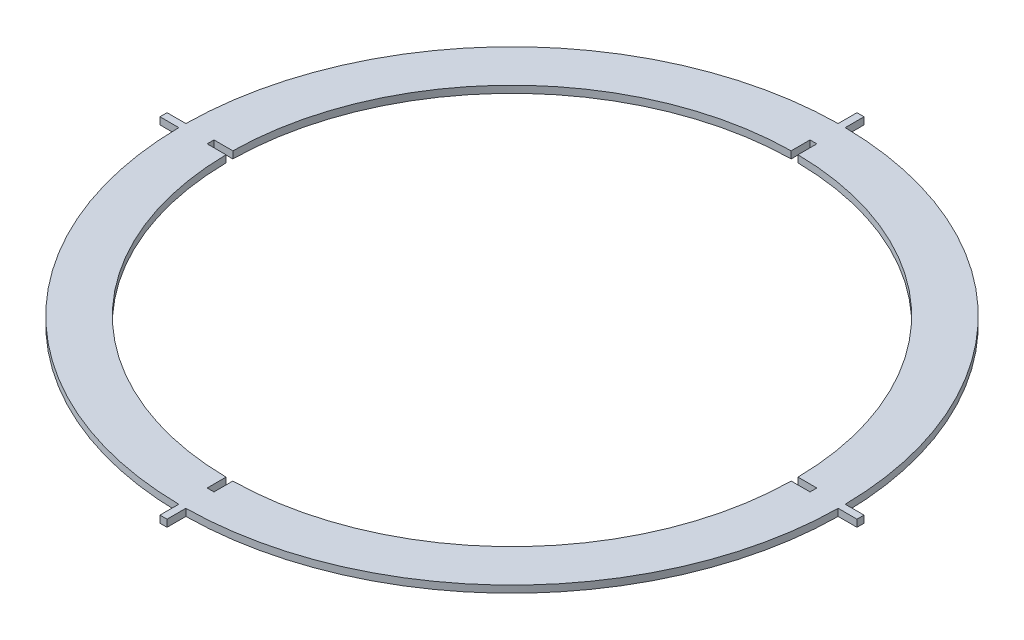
ISO-10303-21;
HEADER;
FILE_DESCRIPTION(('STEP AP214'),'2;1');
FILE_NAME('part.step','',(''),(''),'','','');
FILE_SCHEMA(('AUTOMOTIVE_DESIGN { 1 0 10303 214 1 1 1 1 }'));
ENDSEC;
DATA;
#1=APPLICATION_CONTEXT('core data for automotive mechanical design processes');
#2=APPLICATION_PROTOCOL_DEFINITION('international standard','automotive_design',2000,#1);
#3=PRODUCT_CONTEXT('',#1,'mechanical');
#4=PRODUCT('Part','Part','',(#3));
#5=PRODUCT_RELATED_PRODUCT_CATEGORY('part','',(#4));
#6=PRODUCT_DEFINITION_FORMATION('','',#4);
#7=PRODUCT_DEFINITION_CONTEXT('part definition',#1,'design');
#8=PRODUCT_DEFINITION('design','',#6,#7);
#9=PRODUCT_DEFINITION_SHAPE('','',#8);
#10=(LENGTH_UNIT() NAMED_UNIT(*) SI_UNIT(.MILLI.,.METRE.));
#11=(NAMED_UNIT(*) PLANE_ANGLE_UNIT() SI_UNIT($,.RADIAN.));
#12=(NAMED_UNIT(*) SI_UNIT($,.STERADIAN.) SOLID_ANGLE_UNIT());
#13=UNCERTAINTY_MEASURE_WITH_UNIT(LENGTH_MEASURE(1.E-05),#10,'distance_accuracy_value','');
#14=(GEOMETRIC_REPRESENTATION_CONTEXT(3) GLOBAL_UNCERTAINTY_ASSIGNED_CONTEXT((#13)) GLOBAL_UNIT_ASSIGNED_CONTEXT((#10,
#11,#12)) REPRESENTATION_CONTEXT('',''));
#15=CARTESIAN_POINT('',(0.,0.,0.));
#16=DIRECTION('',(0.,0.,1.));
#17=DIRECTION('',(1.,0.,0.));
#18=AXIS2_PLACEMENT_3D('',#15,#16,#17);
#19=CARTESIAN_POINT('',(0.,3.,-1.50000000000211));
#20=DIRECTION('',(0.,0.,1.));
#21=DIRECTION('',(1.,0.,0.));
#22=AXIS2_PLACEMENT_3D('',#19,#20,#21);
#23=PLANE('',#22);
#24=DIRECTION('',(-1.,0.,0.));
#25=VECTOR('',#24,1.);
#26=CARTESIAN_POINT('',(0.,0.,-1.50000000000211));
#27=LINE('',#26,#25);
#28=CARTESIAN_POINT('',(147.991964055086,0.,-1.50000000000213));
#29=VERTEX_POINT('',#28);
#30=CARTESIAN_POINT('',(139.991964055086,0.,-1.50000000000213));
#31=VERTEX_POINT('',#30);
#32=EDGE_CURVE('E322',#29,#31,#27,.T.);
#33=ORIENTED_EDGE('',*,*,#32,.T.);
#34=DIRECTION('',(0.,-1.,0.));
#35=VECTOR('',#34,1.);
#36=CARTESIAN_POINT('',(139.991964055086,3.,-1.50000000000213));
#37=LINE('',#36,#35);
#38=CARTESIAN_POINT('',(139.991964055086,3.,-1.50000000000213));
#39=VERTEX_POINT('',#38);
#40=EDGE_CURVE('E11',#39,#31,#37,.T.);
#41=ORIENTED_EDGE('',*,*,#40,.F.);
#42=DIRECTION('',(-1.,0.,0.));
#43=VECTOR('',#42,1.);
#44=CARTESIAN_POINT('',(0.,3.,-1.50000000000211));
#45=LINE('',#44,#43);
#46=CARTESIAN_POINT('',(147.991964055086,3.,-1.50000000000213));
#47=VERTEX_POINT('',#46);
#48=EDGE_CURVE('E480',#47,#39,#45,.T.);
#49=ORIENTED_EDGE('',*,*,#48,.F.);
#50=DIRECTION('',(0.,-1.,0.));
#51=VECTOR('',#50,1.);
#52=CARTESIAN_POINT('',(147.991964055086,3.,-1.50000000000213));
#53=LINE('',#52,#51);
#54=EDGE_CURVE('E360',#47,#29,#53,.T.);
#55=ORIENTED_EDGE('',*,*,#54,.T.);
#56=EDGE_LOOP('',(#33,#41,#49,#55));
#57=FACE_BOUND('',#56,.T.);
#58=ADVANCED_FACE('F35',(#57),#23,.F.);
#59=CARTESIAN_POINT('',(0.,3.,0.));
#60=DIRECTION('',(0.,-1.,0.));
#61=DIRECTION('',(0.,0.,-1.));
#62=AXIS2_PLACEMENT_3D('',#59,#60,#61);
#63=CYLINDRICAL_SURFACE('',#62,140.000000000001);
#64=CARTESIAN_POINT('',(0.,0.,0.));
#65=DIRECTION('',(0.,1.,0.));
#66=DIRECTION('',(0.,0.,1.));
#67=AXIS2_PLACEMENT_3D('',#64,#65,#66);
#68=CIRCLE('',#67,140.000000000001);
#69=CARTESIAN_POINT('',(1.50000000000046,0.,-139.991964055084));
#70=VERTEX_POINT('',#69);
#71=EDGE_CURVE('E325',#31,#70,#68,.T.);
#72=ORIENTED_EDGE('',*,*,#71,.T.);
#73=DIRECTION('',(0.,-1.,0.));
#74=VECTOR('',#73,1.);
#75=CARTESIAN_POINT('',(1.50000000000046,3.,-139.991964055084));
#76=LINE('',#75,#74);
#77=CARTESIAN_POINT('',(1.50000000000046,3.,-139.991964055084));
#78=VERTEX_POINT('',#77);
#79=EDGE_CURVE('E45',#78,#70,#76,.T.);
#80=ORIENTED_EDGE('',*,*,#79,.F.);
#81=CARTESIAN_POINT('',(0.,3.,0.));
#82=DIRECTION('',(0.,1.,0.));
#83=DIRECTION('',(0.,0.,1.));
#84=AXIS2_PLACEMENT_3D('',#81,#82,#83);
#85=CIRCLE('',#84,140.000000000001);
#86=EDGE_CURVE('E482',#39,#78,#85,.T.);
#87=ORIENTED_EDGE('',*,*,#86,.F.);
#88=ORIENTED_EDGE('',*,*,#40,.T.);
#89=EDGE_LOOP('',(#72,#80,#87,#88));
#90=FACE_BOUND('',#89,.T.);
#91=ADVANCED_FACE('F534',(#90),#63,.T.);
#92=CARTESIAN_POINT('',(1.49999999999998,3.,0.));
#93=DIRECTION('',(1.,0.,0.));
#94=DIRECTION('',(0.,0.,-1.));
#95=AXIS2_PLACEMENT_3D('',#92,#93,#94);
#96=PLANE('',#95);
#97=DIRECTION('',(0.,0.,1.));
#98=VECTOR('',#97,1.);
#99=CARTESIAN_POINT('',(1.49999999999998,0.,0.));
#100=LINE('',#99,#98);
#101=CARTESIAN_POINT('',(1.50000000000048,0.,-147.991964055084));
#102=VERTEX_POINT('',#101);
#103=EDGE_CURVE('E328',#102,#70,#100,.T.);
#104=ORIENTED_EDGE('',*,*,#103,.F.);
#105=DIRECTION('',(0.,-1.,0.));
#106=VECTOR('',#105,1.);
#107=CARTESIAN_POINT('',(1.50000000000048,3.,-147.991964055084));
#108=LINE('',#107,#106);
#109=CARTESIAN_POINT('',(1.50000000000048,3.,-147.991964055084));
#110=VERTEX_POINT('',#109);
#111=EDGE_CURVE('E387',#110,#102,#108,.T.);
#112=ORIENTED_EDGE('',*,*,#111,.F.);
#113=DIRECTION('',(0.,0.,1.));
#114=VECTOR('',#113,1.);
#115=CARTESIAN_POINT('',(1.49999999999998,3.,0.));
#116=LINE('',#115,#114);
#117=EDGE_CURVE('E484',#110,#78,#116,.T.);
#118=ORIENTED_EDGE('',*,*,#117,.T.);
#119=ORIENTED_EDGE('',*,*,#79,.T.);
#120=EDGE_LOOP('',(#104,#112,#118,#119));
#121=FACE_BOUND('',#120,.T.);
#122=ADVANCED_FACE('F539',(#121),#96,.T.);
#123=CARTESIAN_POINT('',(0.,3.,-147.991964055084));
#124=DIRECTION('',(0.,0.,1.));
#125=DIRECTION('',(1.,0.,0.));
#126=AXIS2_PLACEMENT_3D('',#123,#124,#125);
#127=PLANE('',#126);
#128=DIRECTION('',(-1.,0.,0.));
#129=VECTOR('',#128,1.);
#130=CARTESIAN_POINT('',(0.,0.,-147.991964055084));
#131=LINE('',#130,#129);
#132=CARTESIAN_POINT('',(-1.49999999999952,0.,-147.991964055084));
#133=VERTEX_POINT('',#132);
#134=EDGE_CURVE('E331',#102,#133,#131,.T.);
#135=ORIENTED_EDGE('',*,*,#134,.T.);
#136=DIRECTION('',(0.,-1.,0.));
#137=VECTOR('',#136,1.);
#138=CARTESIAN_POINT('',(-1.49999999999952,3.,-147.991964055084));
#139=LINE('',#138,#137);
#140=CARTESIAN_POINT('',(-1.49999999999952,3.,-147.991964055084));
#141=VERTEX_POINT('',#140);
#142=EDGE_CURVE('E384',#141,#133,#139,.T.);
#143=ORIENTED_EDGE('',*,*,#142,.F.);
#144=DIRECTION('',(-1.,0.,0.));
#145=VECTOR('',#144,1.);
#146=CARTESIAN_POINT('',(0.,3.,-147.991964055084));
#147=LINE('',#146,#145);
#148=EDGE_CURVE('E487',#110,#141,#147,.T.);
#149=ORIENTED_EDGE('',*,*,#148,.F.);
#150=ORIENTED_EDGE('',*,*,#111,.T.);
#151=EDGE_LOOP('',(#135,#143,#149,#150));
#152=FACE_BOUND('',#151,.T.);
#153=ADVANCED_FACE('F633',(#152),#127,.F.);
#154=CARTESIAN_POINT('',(-1.50000000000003,3.,0.));
#155=DIRECTION('',(1.,0.,0.));
#156=DIRECTION('',(0.,0.,-1.));
#157=AXIS2_PLACEMENT_3D('',#154,#155,#156);
#158=PLANE('',#157);
#159=DIRECTION('',(0.,0.,1.));
#160=VECTOR('',#159,1.);
#161=CARTESIAN_POINT('',(-1.50000000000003,0.,0.));
#162=LINE('',#161,#160);
#163=CARTESIAN_POINT('',(-1.49999999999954,0.,-139.991964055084));
#164=VERTEX_POINT('',#163);
#165=EDGE_CURVE('E333',#133,#164,#162,.T.);
#166=ORIENTED_EDGE('',*,*,#165,.T.);
#167=DIRECTION('',(0.,-1.,0.));
#168=VECTOR('',#167,1.);
#169=CARTESIAN_POINT('',(-1.49999999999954,3.,-139.991964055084));
#170=LINE('',#169,#168);
#171=CARTESIAN_POINT('',(-1.49999999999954,3.,-139.991964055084));
#172=VERTEX_POINT('',#171);
#173=EDGE_CURVE('E381',#172,#164,#170,.T.);
#174=ORIENTED_EDGE('',*,*,#173,.F.);
#175=DIRECTION('',(0.,0.,1.));
#176=VECTOR('',#175,1.);
#177=CARTESIAN_POINT('',(-1.50000000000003,3.,0.));
#178=LINE('',#177,#176);
#179=EDGE_CURVE('E489',#141,#172,#178,.T.);
#180=ORIENTED_EDGE('',*,*,#179,.F.);
#181=ORIENTED_EDGE('',*,*,#142,.T.);
#182=EDGE_LOOP('',(#166,#174,#180,#181));
#183=FACE_BOUND('',#182,.T.);
#184=ADVANCED_FACE('F629',(#183),#158,.F.);
#185=CARTESIAN_POINT('',(0.,3.,0.));
#186=DIRECTION('',(0.,-1.,0.));
#187=DIRECTION('',(0.,0.,-1.));
#188=AXIS2_PLACEMENT_3D('',#185,#186,#187);
#189=CYLINDRICAL_SURFACE('',#188,140.);
#190=CARTESIAN_POINT('',(0.,0.,0.));
#191=DIRECTION('',(0.,1.,0.));
#192=DIRECTION('',(0.,0.,1.));
#193=AXIS2_PLACEMENT_3D('',#190,#191,#192);
#194=CIRCLE('',#193,140.);
#195=CARTESIAN_POINT('',(-139.991964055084,0.,-1.49999999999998));
#196=VERTEX_POINT('',#195);
#197=EDGE_CURVE('E335',#164,#196,#194,.T.);
#198=ORIENTED_EDGE('',*,*,#197,.T.);
#199=DIRECTION('',(0.,-1.,0.));
#200=VECTOR('',#199,1.);
#201=CARTESIAN_POINT('',(-139.991964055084,3.,-1.49999999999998));
#202=LINE('',#201,#200);
#203=CARTESIAN_POINT('',(-139.991964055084,3.,-1.49999999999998));
#204=VERTEX_POINT('',#203);
#205=EDGE_CURVE('E379',#204,#196,#202,.T.);
#206=ORIENTED_EDGE('',*,*,#205,.F.);
#207=CARTESIAN_POINT('',(0.,3.,0.));
#208=DIRECTION('',(0.,1.,0.));
#209=DIRECTION('',(0.,0.,1.));
#210=AXIS2_PLACEMENT_3D('',#207,#208,#209);
#211=CIRCLE('',#210,140.);
#212=EDGE_CURVE('E491',#172,#204,#211,.T.);
#213=ORIENTED_EDGE('',*,*,#212,.F.);
#214=ORIENTED_EDGE('',*,*,#173,.T.);
#215=EDGE_LOOP('',(#198,#206,#213,#214));
#216=FACE_BOUND('',#215,.T.);
#217=ADVANCED_FACE('F625',(#216),#189,.T.);
#218=CARTESIAN_POINT('',(0.,3.,-1.5));
#219=DIRECTION('',(0.,0.,-1.));
#220=DIRECTION('',(-1.,0.,0.));
#221=AXIS2_PLACEMENT_3D('',#218,#219,#220);
#222=PLANE('',#221);
#223=DIRECTION('',(1.,0.,0.));
#224=VECTOR('',#223,1.);
#225=CARTESIAN_POINT('',(0.,0.,-1.5));
#226=LINE('',#225,#224);
#227=CARTESIAN_POINT('',(-147.991964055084,0.,-1.49999999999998));
#228=VERTEX_POINT('',#227);
#229=EDGE_CURVE('E338',#228,#196,#226,.T.);
#230=ORIENTED_EDGE('',*,*,#229,.F.);
#231=DIRECTION('',(0.,-1.,0.));
#232=VECTOR('',#231,1.);
#233=CARTESIAN_POINT('',(-147.991964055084,3.,-1.49999999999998));
#234=LINE('',#233,#232);
#235=CARTESIAN_POINT('',(-147.991964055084,3.,-1.49999999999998));
#236=VERTEX_POINT('',#235);
#237=EDGE_CURVE('E377',#236,#228,#234,.T.);
#238=ORIENTED_EDGE('',*,*,#237,.F.);
#239=DIRECTION('',(1.,0.,0.));
#240=VECTOR('',#239,1.);
#241=CARTESIAN_POINT('',(0.,3.,-1.5));
#242=LINE('',#241,#240);
#243=EDGE_CURVE('E493',#236,#204,#242,.T.);
#244=ORIENTED_EDGE('',*,*,#243,.T.);
#245=ORIENTED_EDGE('',*,*,#205,.T.);
#246=EDGE_LOOP('',(#230,#238,#244,#245));
#247=FACE_BOUND('',#246,.T.);
#248=ADVANCED_FACE('F621',(#247),#222,.T.);
#249=CARTESIAN_POINT('',(-147.991964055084,3.,0.));
#250=DIRECTION('',(1.,0.,0.));
#251=DIRECTION('',(0.,0.,-1.));
#252=AXIS2_PLACEMENT_3D('',#249,#250,#251);
#253=PLANE('',#252);
#254=DIRECTION('',(0.,0.,1.));
#255=VECTOR('',#254,1.);
#256=CARTESIAN_POINT('',(-147.991964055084,0.,0.));
#257=LINE('',#256,#255);
#258=CARTESIAN_POINT('',(-147.991964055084,0.,1.50000000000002));
#259=VERTEX_POINT('',#258);
#260=EDGE_CURVE('E341',#228,#259,#257,.T.);
#261=ORIENTED_EDGE('',*,*,#260,.T.);
#262=DIRECTION('',(0.,-1.,0.));
#263=VECTOR('',#262,1.);
#264=CARTESIAN_POINT('',(-147.991964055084,3.,1.50000000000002));
#265=LINE('',#264,#263);
#266=CARTESIAN_POINT('',(-147.991964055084,3.,1.50000000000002));
#267=VERTEX_POINT('',#266);
#268=EDGE_CURVE('E374',#267,#259,#265,.T.);
#269=ORIENTED_EDGE('',*,*,#268,.F.);
#270=DIRECTION('',(0.,0.,1.));
#271=VECTOR('',#270,1.);
#272=CARTESIAN_POINT('',(-147.991964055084,3.,0.));
#273=LINE('',#272,#271);
#274=EDGE_CURVE('E496',#236,#267,#273,.T.);
#275=ORIENTED_EDGE('',*,*,#274,.F.);
#276=ORIENTED_EDGE('',*,*,#237,.T.);
#277=EDGE_LOOP('',(#261,#269,#275,#276));
#278=FACE_BOUND('',#277,.T.);
#279=ADVANCED_FACE('F617',(#278),#253,.F.);
#280=CARTESIAN_POINT('',(0.,3.,1.50000000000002));
#281=DIRECTION('',(0.,0.,-1.));
#282=DIRECTION('',(-1.,0.,0.));
#283=AXIS2_PLACEMENT_3D('',#280,#281,#282);
#284=PLANE('',#283);
#285=DIRECTION('',(1.,0.,0.));
#286=VECTOR('',#285,1.);
#287=CARTESIAN_POINT('',(0.,0.,1.50000000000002));
#288=LINE('',#287,#286);
#289=CARTESIAN_POINT('',(-139.991964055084,0.,1.50000000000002));
#290=VERTEX_POINT('',#289);
#291=EDGE_CURVE('E343',#259,#290,#288,.T.);
#292=ORIENTED_EDGE('',*,*,#291,.T.);
#293=DIRECTION('',(0.,-1.,0.));
#294=VECTOR('',#293,1.);
#295=CARTESIAN_POINT('',(-139.991964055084,3.,1.50000000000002));
#296=LINE('',#295,#294);
#297=CARTESIAN_POINT('',(-139.991964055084,3.,1.50000000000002));
#298=VERTEX_POINT('',#297);
#299=EDGE_CURVE('E371',#298,#290,#296,.T.);
#300=ORIENTED_EDGE('',*,*,#299,.F.);
#301=DIRECTION('',(1.,0.,0.));
#302=VECTOR('',#301,1.);
#303=CARTESIAN_POINT('',(0.,3.,1.50000000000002));
#304=LINE('',#303,#302);
#305=EDGE_CURVE('E498',#267,#298,#304,.T.);
#306=ORIENTED_EDGE('',*,*,#305,.F.);
#307=ORIENTED_EDGE('',*,*,#268,.T.);
#308=EDGE_LOOP('',(#292,#300,#306,#307));
#309=FACE_BOUND('',#308,.T.);
#310=ADVANCED_FACE('F613',(#309),#284,.F.);
#311=CARTESIAN_POINT('',(0.,3.,0.));
#312=DIRECTION('',(0.,-1.,0.));
#313=DIRECTION('',(0.,0.,-1.));
#314=AXIS2_PLACEMENT_3D('',#311,#312,#313);
#315=CYLINDRICAL_SURFACE('',#314,140.);
#316=CARTESIAN_POINT('',(0.,0.,0.));
#317=DIRECTION('',(0.,1.,0.));
#318=DIRECTION('',(0.,0.,1.));
#319=AXIS2_PLACEMENT_3D('',#316,#317,#318);
#320=CIRCLE('',#319,140.);
#321=CARTESIAN_POINT('',(-1.49999999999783,0.,139.991964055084));
#322=VERTEX_POINT('',#321);
#323=EDGE_CURVE('E345',#290,#322,#320,.T.);
#324=ORIENTED_EDGE('',*,*,#323,.T.);
#325=DIRECTION('',(0.,-1.,0.));
#326=VECTOR('',#325,1.);
#327=CARTESIAN_POINT('',(-1.49999999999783,3.,139.991964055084));
#328=LINE('',#327,#326);
#329=CARTESIAN_POINT('',(-1.49999999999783,3.,139.991964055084));
#330=VERTEX_POINT('',#329);
#331=EDGE_CURVE('E369',#330,#322,#328,.T.);
#332=ORIENTED_EDGE('',*,*,#331,.F.);
#333=CARTESIAN_POINT('',(0.,3.,0.));
#334=DIRECTION('',(0.,1.,0.));
#335=DIRECTION('',(0.,0.,1.));
#336=AXIS2_PLACEMENT_3D('',#333,#334,#335);
#337=CIRCLE('',#336,140.);
#338=EDGE_CURVE('E500',#298,#330,#337,.T.);
#339=ORIENTED_EDGE('',*,*,#338,.F.);
#340=ORIENTED_EDGE('',*,*,#299,.T.);
#341=EDGE_LOOP('',(#324,#332,#339,#340));
#342=FACE_BOUND('',#341,.T.);
#343=ADVANCED_FACE('F609',(#342),#315,.T.);
#344=CARTESIAN_POINT('',(-1.49999999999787,3.,0.));
#345=DIRECTION('',(-1.,0.,0.));
#346=DIRECTION('',(0.,0.,1.));
#347=AXIS2_PLACEMENT_3D('',#344,#345,#346);
#348=PLANE('',#347);
#349=DIRECTION('',(0.,0.,-1.));
#350=VECTOR('',#349,1.);
#351=CARTESIAN_POINT('',(-1.49999999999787,0.,0.));
#352=LINE('',#351,#350);
#353=CARTESIAN_POINT('',(-1.49999999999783,0.,147.991964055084));
#354=VERTEX_POINT('',#353);
#355=EDGE_CURVE('E348',#354,#322,#352,.T.);
#356=ORIENTED_EDGE('',*,*,#355,.F.);
#357=DIRECTION('',(0.,-1.,0.));
#358=VECTOR('',#357,1.);
#359=CARTESIAN_POINT('',(-1.49999999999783,3.,147.991964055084));
#360=LINE('',#359,#358);
#361=CARTESIAN_POINT('',(-1.49999999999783,3.,147.991964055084));
#362=VERTEX_POINT('',#361);
#363=EDGE_CURVE('E367',#362,#354,#360,.T.);
#364=ORIENTED_EDGE('',*,*,#363,.F.);
#365=DIRECTION('',(0.,0.,-1.));
#366=VECTOR('',#365,1.);
#367=CARTESIAN_POINT('',(-1.49999999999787,3.,0.));
#368=LINE('',#367,#366);
#369=EDGE_CURVE('E502',#362,#330,#368,.T.);
#370=ORIENTED_EDGE('',*,*,#369,.T.);
#371=ORIENTED_EDGE('',*,*,#331,.T.);
#372=EDGE_LOOP('',(#356,#364,#370,#371));
#373=FACE_BOUND('',#372,.T.);
#374=ADVANCED_FACE('F606',(#373),#348,.T.);
#375=CARTESIAN_POINT('',(0.,3.,147.991964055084));
#376=DIRECTION('',(0.,0.,-1.));
#377=DIRECTION('',(-1.,0.,0.));
#378=AXIS2_PLACEMENT_3D('',#375,#376,#377);
#379=PLANE('',#378);
#380=DIRECTION('',(1.,0.,0.));
#381=VECTOR('',#380,1.);
#382=CARTESIAN_POINT('',(0.,0.,147.991964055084));
#383=LINE('',#382,#381);
#384=CARTESIAN_POINT('',(1.50000000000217,0.,147.991964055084));
#385=VERTEX_POINT('',#384);
#386=EDGE_CURVE('E351',#354,#385,#383,.T.);
#387=ORIENTED_EDGE('',*,*,#386,.T.);
#388=DIRECTION('',(0.,-1.,0.));
#389=VECTOR('',#388,1.);
#390=CARTESIAN_POINT('',(1.50000000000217,3.,147.991964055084));
#391=LINE('',#390,#389);
#392=CARTESIAN_POINT('',(1.50000000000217,3.,147.991964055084));
#393=VERTEX_POINT('',#392);
#394=EDGE_CURVE('E364',#393,#385,#391,.T.);
#395=ORIENTED_EDGE('',*,*,#394,.F.);
#396=DIRECTION('',(1.,0.,0.));
#397=VECTOR('',#396,1.);
#398=CARTESIAN_POINT('',(0.,3.,147.991964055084));
#399=LINE('',#398,#397);
#400=EDGE_CURVE('E505',#362,#393,#399,.T.);
#401=ORIENTED_EDGE('',*,*,#400,.F.);
#402=ORIENTED_EDGE('',*,*,#363,.T.);
#403=EDGE_LOOP('',(#387,#395,#401,#402));
#404=FACE_BOUND('',#403,.T.);
#405=ADVANCED_FACE('F510',(#404),#379,.F.);
#406=CARTESIAN_POINT('',(1.50000000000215,3.,0.));
#407=DIRECTION('',(-1.,0.,0.));
#408=DIRECTION('',(0.,0.,1.));
#409=AXIS2_PLACEMENT_3D('',#406,#407,#408);
#410=PLANE('',#409);
#411=DIRECTION('',(0.,0.,-1.));
#412=VECTOR('',#411,1.);
#413=CARTESIAN_POINT('',(1.50000000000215,0.,0.));
#414=LINE('',#413,#412);
#415=CARTESIAN_POINT('',(1.50000000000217,0.,139.991964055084));
#416=VERTEX_POINT('',#415);
#417=EDGE_CURVE('E353',#385,#416,#414,.T.);
#418=ORIENTED_EDGE('',*,*,#417,.T.);
#419=DIRECTION('',(0.,-1.,0.));
#420=VECTOR('',#419,1.);
#421=CARTESIAN_POINT('',(1.50000000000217,3.,139.991964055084));
#422=LINE('',#421,#420);
#423=CARTESIAN_POINT('',(1.50000000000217,3.,139.991964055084));
#424=VERTEX_POINT('',#423);
#425=EDGE_CURVE('E270',#424,#416,#422,.T.);
#426=ORIENTED_EDGE('',*,*,#425,.F.);
#427=DIRECTION('',(0.,0.,-1.));
#428=VECTOR('',#427,1.);
#429=CARTESIAN_POINT('',(1.50000000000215,3.,0.));
#430=LINE('',#429,#428);
#431=EDGE_CURVE('E257',#393,#424,#430,.T.);
#432=ORIENTED_EDGE('',*,*,#431,.F.);
#433=ORIENTED_EDGE('',*,*,#394,.T.);
#434=EDGE_LOOP('',(#418,#426,#432,#433));
#435=FACE_BOUND('',#434,.T.);
#436=ADVANCED_FACE('F514',(#435),#410,.F.);
#437=CARTESIAN_POINT('',(0.,3.,0.));
#438=DIRECTION('',(0.,-1.,0.));
#439=DIRECTION('',(0.,0.,-1.));
#440=AXIS2_PLACEMENT_3D('',#437,#438,#439);
#441=CYLINDRICAL_SURFACE('',#440,140.000000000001);
#442=CARTESIAN_POINT('',(0.,0.,0.));
#443=DIRECTION('',(0.,1.,0.));
#444=DIRECTION('',(0.,0.,1.));
#445=AXIS2_PLACEMENT_3D('',#442,#443,#444);
#446=CIRCLE('',#445,140.000000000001);
#447=CARTESIAN_POINT('',(139.991964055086,0.,1.49999999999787));
#448=VERTEX_POINT('',#447);
#449=EDGE_CURVE('E266',#416,#448,#446,.T.);
#450=ORIENTED_EDGE('',*,*,#449,.T.);
#451=DIRECTION('',(0.,-1.,0.));
#452=VECTOR('',#451,1.);
#453=CARTESIAN_POINT('',(139.991964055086,3.,1.49999999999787));
#454=LINE('',#453,#452);
#455=CARTESIAN_POINT('',(139.991964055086,3.,1.49999999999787));
#456=VERTEX_POINT('',#455);
#457=EDGE_CURVE('E263',#456,#448,#454,.T.);
#458=ORIENTED_EDGE('',*,*,#457,.F.);
#459=CARTESIAN_POINT('',(0.,3.,0.));
#460=DIRECTION('',(0.,1.,0.));
#461=DIRECTION('',(0.,0.,1.));
#462=AXIS2_PLACEMENT_3D('',#459,#460,#461);
#463=CIRCLE('',#462,140.000000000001);
#464=EDGE_CURVE('E251',#424,#456,#463,.T.);
#465=ORIENTED_EDGE('',*,*,#464,.F.);
#466=ORIENTED_EDGE('',*,*,#425,.T.);
#467=EDGE_LOOP('',(#450,#458,#465,#466));
#468=FACE_BOUND('',#467,.T.);
#469=ADVANCED_FACE('F264',(#468),#441,.T.);
#470=CARTESIAN_POINT('',(0.,3.,1.49999999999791));
#471=DIRECTION('',(0.,0.,1.));
#472=DIRECTION('',(1.,0.,0.));
#473=AXIS2_PLACEMENT_3D('',#470,#471,#472);
#474=PLANE('',#473);
#475=DIRECTION('',(-1.,0.,0.));
#476=VECTOR('',#475,1.);
#477=CARTESIAN_POINT('',(0.,0.,1.49999999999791));
#478=LINE('',#477,#476);
#479=CARTESIAN_POINT('',(147.991964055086,0.,1.49999999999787));
#480=VERTEX_POINT('',#479);
#481=EDGE_CURVE('E356',#480,#448,#478,.T.);
#482=ORIENTED_EDGE('',*,*,#481,.F.);
#483=DIRECTION('',(0.,-1.,0.));
#484=VECTOR('',#483,1.);
#485=CARTESIAN_POINT('',(147.991964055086,3.,1.49999999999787));
#486=LINE('',#485,#484);
#487=CARTESIAN_POINT('',(147.991964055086,3.,1.49999999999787));
#488=VERTEX_POINT('',#487);
#489=EDGE_CURVE('E154',#488,#480,#486,.T.);
#490=ORIENTED_EDGE('',*,*,#489,.F.);
#491=DIRECTION('',(-1.,0.,0.));
#492=VECTOR('',#491,1.);
#493=CARTESIAN_POINT('',(0.,3.,1.49999999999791));
#494=LINE('',#493,#492);
#495=EDGE_CURVE('E255',#488,#456,#494,.T.);
#496=ORIENTED_EDGE('',*,*,#495,.T.);
#497=ORIENTED_EDGE('',*,*,#457,.T.);
#498=EDGE_LOOP('',(#482,#490,#496,#497));
#499=FACE_BOUND('',#498,.T.);
#500=ADVANCED_FACE('F272',(#499),#474,.T.);
#501=CARTESIAN_POINT('',(0.,3.,0.));
#502=DIRECTION('',(0.,-1.,0.));
#503=DIRECTION('',(0.,0.,-1.));
#504=AXIS2_PLACEMENT_3D('',#501,#502,#503);
#505=CYLINDRICAL_SURFACE('',#504,120.);
#506=CARTESIAN_POINT('',(0.,0.,0.));
#507=DIRECTION('',(0.,1.,0.));
#508=DIRECTION('',(0.,0.,1.));
#509=AXIS2_PLACEMENT_3D('',#506,#507,#508);
#510=CIRCLE('',#509,120.);
#511=CARTESIAN_POINT('',(119.99123926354,0.,-1.45000000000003));
#512=VERTEX_POINT('',#511);
#513=CARTESIAN_POINT('',(1.44999999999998,0.,-119.99123926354));
#514=VERTEX_POINT('',#513);
#515=EDGE_CURVE('E278',#512,#514,#510,.T.);
#516=ORIENTED_EDGE('',*,*,#515,.F.);
#517=DIRECTION('',(0.,-1.,0.));
#518=VECTOR('',#517,1.);
#519=CARTESIAN_POINT('',(119.99123926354,3.,-1.45000000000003));
#520=LINE('',#519,#518);
#521=CARTESIAN_POINT('',(119.99123926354,3.,-1.45000000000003));
#522=VERTEX_POINT('',#521);
#523=EDGE_CURVE('E39',#522,#512,#520,.T.);
#524=ORIENTED_EDGE('',*,*,#523,.F.);
#525=CARTESIAN_POINT('',(0.,3.,0.));
#526=DIRECTION('',(0.,1.,0.));
#527=DIRECTION('',(0.,0.,1.));
#528=AXIS2_PLACEMENT_3D('',#525,#526,#527);
#529=CIRCLE('',#528,120.);
#530=CARTESIAN_POINT('',(1.44999999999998,3.,-119.99123926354));
#531=VERTEX_POINT('',#530);
#532=EDGE_CURVE('E359',#522,#531,#529,.T.);
#533=ORIENTED_EDGE('',*,*,#532,.T.);
#534=DIRECTION('',(0.,-1.,0.));
#535=VECTOR('',#534,1.);
#536=CARTESIAN_POINT('',(1.44999999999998,3.,-119.99123926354));
#537=LINE('',#536,#535);
#538=EDGE_CURVE('E274',#531,#514,#537,.T.);
#539=ORIENTED_EDGE('',*,*,#538,.T.);
#540=EDGE_LOOP('',(#516,#524,#533,#539));
#541=FACE_BOUND('',#540,.T.);
#542=ADVANCED_FACE('F37',(#541),#505,.F.);
#543=CARTESIAN_POINT('',(0.,3.,-1.45000000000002));
#544=DIRECTION('',(0.,0.,1.));
#545=DIRECTION('',(1.,0.,0.));
#546=AXIS2_PLACEMENT_3D('',#543,#544,#545);
#547=PLANE('',#546);
#548=DIRECTION('',(-1.,0.,0.));
#549=VECTOR('',#548,1.);
#550=CARTESIAN_POINT('',(0.,0.,-1.45000000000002));
#551=LINE('',#550,#549);
#552=CARTESIAN_POINT('',(127.99123926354,0.,-1.45000000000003));
#553=VERTEX_POINT('',#552);
#554=EDGE_CURVE('E281',#553,#512,#551,.T.);
#555=ORIENTED_EDGE('',*,*,#554,.F.);
#556=DIRECTION('',(0.,-1.,0.));
#557=VECTOR('',#556,1.);
#558=CARTESIAN_POINT('',(127.99123926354,3.,-1.45000000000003));
#559=LINE('',#558,#557);
#560=CARTESIAN_POINT('',(127.99123926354,3.,-1.45000000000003));
#561=VERTEX_POINT('',#560);
#562=EDGE_CURVE('E420',#561,#553,#559,.T.);
#563=ORIENTED_EDGE('',*,*,#562,.F.);
#564=DIRECTION('',(-1.,0.,0.));
#565=VECTOR('',#564,1.);
#566=CARTESIAN_POINT('',(0.,3.,-1.45000000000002));
#567=LINE('',#566,#565);
#568=EDGE_CURVE('E429',#561,#522,#567,.T.);
#569=ORIENTED_EDGE('',*,*,#568,.T.);
#570=ORIENTED_EDGE('',*,*,#523,.T.);
#571=EDGE_LOOP('',(#555,#563,#569,#570));
#572=FACE_BOUND('',#571,.T.);
#573=ADVANCED_FACE('F427',(#572),#547,.T.);
#574=CARTESIAN_POINT('',(127.99123926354,3.,0.));
#575=DIRECTION('',(1.,0.,0.));
#576=DIRECTION('',(0.,0.,-1.));
#577=AXIS2_PLACEMENT_3D('',#574,#575,#576);
#578=PLANE('',#577);
#579=DIRECTION('',(0.,0.,1.));
#580=VECTOR('',#579,1.);
#581=CARTESIAN_POINT('',(127.99123926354,0.,0.));
#582=LINE('',#581,#580);
#583=CARTESIAN_POINT('',(127.99123926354,0.,1.44999999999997));
#584=VERTEX_POINT('',#583);
#585=EDGE_CURVE('E284',#553,#584,#582,.T.);
#586=ORIENTED_EDGE('',*,*,#585,.T.);
#587=DIRECTION('',(0.,-1.,0.));
#588=VECTOR('',#587,1.);
#589=CARTESIAN_POINT('',(127.99123926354,3.,1.44999999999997));
#590=LINE('',#589,#588);
#591=CARTESIAN_POINT('',(127.99123926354,3.,1.44999999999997));
#592=VERTEX_POINT('',#591);
#593=EDGE_CURVE('E418',#592,#584,#590,.T.);
#594=ORIENTED_EDGE('',*,*,#593,.F.);
#595=DIRECTION('',(0.,0.,1.));
#596=VECTOR('',#595,1.);
#597=CARTESIAN_POINT('',(127.99123926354,3.,0.));
#598=LINE('',#597,#596);
#599=EDGE_CURVE('E447',#561,#592,#598,.T.);
#600=ORIENTED_EDGE('',*,*,#599,.F.);
#601=ORIENTED_EDGE('',*,*,#562,.T.);
#602=EDGE_LOOP('',(#586,#594,#600,#601));
#603=FACE_BOUND('',#602,.T.);
#604=ADVANCED_FACE('F437',(#603),#578,.F.);
#605=CARTESIAN_POINT('',(0.,3.,1.45000000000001));
#606=DIRECTION('',(0.,0.,1.));
#607=DIRECTION('',(1.,0.,0.));
#608=AXIS2_PLACEMENT_3D('',#605,#606,#607);
#609=PLANE('',#608);
#610=DIRECTION('',(-1.,0.,0.));
#611=VECTOR('',#610,1.);
#612=CARTESIAN_POINT('',(0.,0.,1.45000000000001));
#613=LINE('',#612,#611);
#614=CARTESIAN_POINT('',(119.99123926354,0.,1.44999999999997));
#615=VERTEX_POINT('',#614);
#616=EDGE_CURVE('E286',#584,#615,#613,.T.);
#617=ORIENTED_EDGE('',*,*,#616,.T.);
#618=DIRECTION('',(0.,-1.,0.));
#619=VECTOR('',#618,1.);
#620=CARTESIAN_POINT('',(119.99123926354,3.,1.44999999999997));
#621=LINE('',#620,#619);
#622=CARTESIAN_POINT('',(119.99123926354,3.,1.44999999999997));
#623=VERTEX_POINT('',#622);
#624=EDGE_CURVE('E416',#623,#615,#621,.T.);
#625=ORIENTED_EDGE('',*,*,#624,.F.);
#626=DIRECTION('',(-1.,0.,0.));
#627=VECTOR('',#626,1.);
#628=CARTESIAN_POINT('',(0.,3.,1.45000000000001));
#629=LINE('',#628,#627);
#630=EDGE_CURVE('E442',#592,#623,#629,.T.);
#631=ORIENTED_EDGE('',*,*,#630,.F.);
#632=ORIENTED_EDGE('',*,*,#593,.T.);
#633=EDGE_LOOP('',(#617,#625,#631,#632));
#634=FACE_BOUND('',#633,.T.);
#635=ADVANCED_FACE('F440',(#634),#609,.F.);
#636=CARTESIAN_POINT('',(0.,3.,0.));
#637=DIRECTION('',(0.,-1.,0.));
#638=DIRECTION('',(0.,0.,-1.));
#639=AXIS2_PLACEMENT_3D('',#636,#637,#638);
#640=CYLINDRICAL_SURFACE('',#639,120.);
#641=CARTESIAN_POINT('',(0.,0.,0.));
#642=DIRECTION('',(0.,1.,0.));
#643=DIRECTION('',(0.,0.,1.));
#644=AXIS2_PLACEMENT_3D('',#641,#642,#643);
#645=CIRCLE('',#644,120.);
#646=CARTESIAN_POINT('',(1.45000000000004,0.,119.99123926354));
#647=VERTEX_POINT('',#646);
#648=EDGE_CURVE('E289',#647,#615,#645,.T.);
#649=ORIENTED_EDGE('',*,*,#648,.F.);
#650=DIRECTION('',(0.,-1.,0.));
#651=VECTOR('',#650,1.);
#652=CARTESIAN_POINT('',(1.45000000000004,3.,119.99123926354));
#653=LINE('',#652,#651);
#654=CARTESIAN_POINT('',(1.45000000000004,3.,119.99123926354));
#655=VERTEX_POINT('',#654);
#656=EDGE_CURVE('E414',#655,#647,#653,.T.);
#657=ORIENTED_EDGE('',*,*,#656,.F.);
#658=CARTESIAN_POINT('',(0.,3.,0.));
#659=DIRECTION('',(0.,1.,0.));
#660=DIRECTION('',(0.,0.,1.));
#661=AXIS2_PLACEMENT_3D('',#658,#659,#660);
#662=CIRCLE('',#661,120.);
#663=EDGE_CURVE('E446',#655,#623,#662,.T.);
#664=ORIENTED_EDGE('',*,*,#663,.T.);
#665=ORIENTED_EDGE('',*,*,#624,.T.);
#666=EDGE_LOOP('',(#649,#657,#664,#665));
#667=FACE_BOUND('',#666,.T.);
#668=ADVANCED_FACE('F582',(#667),#640,.F.);
#669=CARTESIAN_POINT('',(1.45000000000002,3.,0.));
#670=DIRECTION('',(-1.,0.,0.));
#671=DIRECTION('',(0.,0.,1.));
#672=AXIS2_PLACEMENT_3D('',#669,#670,#671);
#673=PLANE('',#672);
#674=DIRECTION('',(0.,0.,-1.));
#675=VECTOR('',#674,1.);
#676=CARTESIAN_POINT('',(1.45000000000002,0.,0.));
#677=LINE('',#676,#675);
#678=CARTESIAN_POINT('',(1.45000000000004,0.,127.99123926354));
#679=VERTEX_POINT('',#678);
#680=EDGE_CURVE('E292',#679,#647,#677,.T.);
#681=ORIENTED_EDGE('',*,*,#680,.F.);
#682=DIRECTION('',(0.,-1.,0.));
#683=VECTOR('',#682,1.);
#684=CARTESIAN_POINT('',(1.45000000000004,3.,127.99123926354));
#685=LINE('',#684,#683);
#686=CARTESIAN_POINT('',(1.45000000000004,3.,127.99123926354));
#687=VERTEX_POINT('',#686);
#688=EDGE_CURVE('E412',#687,#679,#685,.T.);
#689=ORIENTED_EDGE('',*,*,#688,.F.);
#690=DIRECTION('',(0.,0.,-1.));
#691=VECTOR('',#690,1.);
#692=CARTESIAN_POINT('',(1.45000000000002,3.,0.));
#693=LINE('',#692,#691);
#694=EDGE_CURVE('E449',#687,#655,#693,.T.);
#695=ORIENTED_EDGE('',*,*,#694,.T.);
#696=ORIENTED_EDGE('',*,*,#656,.T.);
#697=EDGE_LOOP('',(#681,#689,#695,#696));
#698=FACE_BOUND('',#697,.T.);
#699=ADVANCED_FACE('F578',(#698),#673,.T.);
#700=CARTESIAN_POINT('',(0.,3.,127.99123926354));
#701=DIRECTION('',(0.,0.,1.));
#702=DIRECTION('',(1.,0.,0.));
#703=AXIS2_PLACEMENT_3D('',#700,#701,#702);
#704=PLANE('',#703);
#705=DIRECTION('',(-1.,0.,0.));
#706=VECTOR('',#705,1.);
#707=CARTESIAN_POINT('',(0.,0.,127.99123926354));
#708=LINE('',#707,#706);
#709=CARTESIAN_POINT('',(-1.44999999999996,0.,127.99123926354));
#710=VERTEX_POINT('',#709);
#711=EDGE_CURVE('E295',#679,#710,#708,.T.);
#712=ORIENTED_EDGE('',*,*,#711,.T.);
#713=DIRECTION('',(0.,-1.,0.));
#714=VECTOR('',#713,1.);
#715=CARTESIAN_POINT('',(-1.44999999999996,3.,127.99123926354));
#716=LINE('',#715,#714);
#717=CARTESIAN_POINT('',(-1.44999999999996,3.,127.99123926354));
#718=VERTEX_POINT('',#717);
#719=EDGE_CURVE('E409',#718,#710,#716,.T.);
#720=ORIENTED_EDGE('',*,*,#719,.F.);
#721=DIRECTION('',(-1.,0.,0.));
#722=VECTOR('',#721,1.);
#723=CARTESIAN_POINT('',(0.,3.,127.99123926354));
#724=LINE('',#723,#722);
#725=EDGE_CURVE('E456',#687,#718,#724,.T.);
#726=ORIENTED_EDGE('',*,*,#725,.F.);
#727=ORIENTED_EDGE('',*,*,#688,.T.);
#728=EDGE_LOOP('',(#712,#720,#726,#727));
#729=FACE_BOUND('',#728,.T.);
#730=ADVANCED_FACE('F574',(#729),#704,.F.);
#731=CARTESIAN_POINT('',(-1.45000000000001,3.,0.));
#732=DIRECTION('',(-1.,0.,0.));
#733=DIRECTION('',(0.,0.,1.));
#734=AXIS2_PLACEMENT_3D('',#731,#732,#733);
#735=PLANE('',#734);
#736=DIRECTION('',(0.,0.,-1.));
#737=VECTOR('',#736,1.);
#738=CARTESIAN_POINT('',(-1.45000000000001,0.,0.));
#739=LINE('',#738,#737);
#740=CARTESIAN_POINT('',(-1.44999999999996,0.,119.99123926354));
#741=VERTEX_POINT('',#740);
#742=EDGE_CURVE('E297',#710,#741,#739,.T.);
#743=ORIENTED_EDGE('',*,*,#742,.T.);
#744=DIRECTION('',(0.,-1.,0.));
#745=VECTOR('',#744,1.);
#746=CARTESIAN_POINT('',(-1.44999999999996,3.,119.99123926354));
#747=LINE('',#746,#745);
#748=CARTESIAN_POINT('',(-1.44999999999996,3.,119.99123926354));
#749=VERTEX_POINT('',#748);
#750=EDGE_CURVE('E407',#749,#741,#747,.T.);
#751=ORIENTED_EDGE('',*,*,#750,.F.);
#752=DIRECTION('',(0.,0.,-1.));
#753=VECTOR('',#752,1.);
#754=CARTESIAN_POINT('',(-1.45000000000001,3.,0.));
#755=LINE('',#754,#753);
#756=EDGE_CURVE('E458',#718,#749,#755,.T.);
#757=ORIENTED_EDGE('',*,*,#756,.F.);
#758=ORIENTED_EDGE('',*,*,#719,.T.);
#759=EDGE_LOOP('',(#743,#751,#757,#758));
#760=FACE_BOUND('',#759,.T.);
#761=ADVANCED_FACE('F570',(#760),#735,.F.);
#762=CARTESIAN_POINT('',(0.,3.,0.));
#763=DIRECTION('',(0.,-1.,0.));
#764=DIRECTION('',(0.,0.,-1.));
#765=AXIS2_PLACEMENT_3D('',#762,#763,#764);
#766=CYLINDRICAL_SURFACE('',#765,120.);
#767=CARTESIAN_POINT('',(0.,0.,0.));
#768=DIRECTION('',(0.,1.,0.));
#769=DIRECTION('',(0.,0.,1.));
#770=AXIS2_PLACEMENT_3D('',#767,#768,#769);
#771=CIRCLE('',#770,120.);
#772=CARTESIAN_POINT('',(-119.99123926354,0.,1.45000000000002));
#773=VERTEX_POINT('',#772);
#774=EDGE_CURVE('E300',#773,#741,#771,.T.);
#775=ORIENTED_EDGE('',*,*,#774,.F.);
#776=DIRECTION('',(0.,-1.,0.));
#777=VECTOR('',#776,1.);
#778=CARTESIAN_POINT('',(-119.99123926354,3.,1.45000000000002));
#779=LINE('',#778,#777);
#780=CARTESIAN_POINT('',(-119.99123926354,3.,1.45000000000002));
#781=VERTEX_POINT('',#780);
#782=EDGE_CURVE('E405',#781,#773,#779,.T.);
#783=ORIENTED_EDGE('',*,*,#782,.F.);
#784=CARTESIAN_POINT('',(0.,3.,0.));
#785=DIRECTION('',(0.,1.,0.));
#786=DIRECTION('',(0.,0.,1.));
#787=AXIS2_PLACEMENT_3D('',#784,#785,#786);
#788=CIRCLE('',#787,120.);
#789=EDGE_CURVE('E460',#781,#749,#788,.T.);
#790=ORIENTED_EDGE('',*,*,#789,.T.);
#791=ORIENTED_EDGE('',*,*,#750,.T.);
#792=EDGE_LOOP('',(#775,#783,#790,#791));
#793=FACE_BOUND('',#792,.T.);
#794=ADVANCED_FACE('F566',(#793),#766,.F.);
#795=CARTESIAN_POINT('',(0.,3.,1.45000000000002));
#796=DIRECTION('',(0.,0.,-1.));
#797=DIRECTION('',(-1.,0.,0.));
#798=AXIS2_PLACEMENT_3D('',#795,#796,#797);
#799=PLANE('',#798);
#800=DIRECTION('',(1.,0.,0.));
#801=VECTOR('',#800,1.);
#802=CARTESIAN_POINT('',(0.,0.,1.45000000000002));
#803=LINE('',#802,#801);
#804=CARTESIAN_POINT('',(-127.99123926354,0.,1.45000000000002));
#805=VERTEX_POINT('',#804);
#806=EDGE_CURVE('E303',#805,#773,#803,.T.);
#807=ORIENTED_EDGE('',*,*,#806,.F.);
#808=DIRECTION('',(0.,-1.,0.));
#809=VECTOR('',#808,1.);
#810=CARTESIAN_POINT('',(-127.99123926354,3.,1.45000000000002));
#811=LINE('',#810,#809);
#812=CARTESIAN_POINT('',(-127.99123926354,3.,1.45000000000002));
#813=VERTEX_POINT('',#812);
#814=EDGE_CURVE('E403',#813,#805,#811,.T.);
#815=ORIENTED_EDGE('',*,*,#814,.F.);
#816=DIRECTION('',(1.,0.,0.));
#817=VECTOR('',#816,1.);
#818=CARTESIAN_POINT('',(0.,3.,1.45000000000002));
#819=LINE('',#818,#817);
#820=EDGE_CURVE('E463',#813,#781,#819,.T.);
#821=ORIENTED_EDGE('',*,*,#820,.T.);
#822=ORIENTED_EDGE('',*,*,#782,.T.);
#823=EDGE_LOOP('',(#807,#815,#821,#822));
#824=FACE_BOUND('',#823,.T.);
#825=ADVANCED_FACE('F562',(#824),#799,.T.);
#826=CARTESIAN_POINT('',(-127.99123926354,3.,0.));
#827=DIRECTION('',(-1.,0.,0.));
#828=DIRECTION('',(0.,0.,1.));
#829=AXIS2_PLACEMENT_3D('',#826,#827,#828);
#830=PLANE('',#829);
#831=DIRECTION('',(0.,0.,-1.));
#832=VECTOR('',#831,1.);
#833=CARTESIAN_POINT('',(-127.99123926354,0.,0.));
#834=LINE('',#833,#832);
#835=CARTESIAN_POINT('',(-127.99123926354,0.,-1.44999999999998));
#836=VERTEX_POINT('',#835);
#837=EDGE_CURVE('E306',#805,#836,#834,.T.);
#838=ORIENTED_EDGE('',*,*,#837,.T.);
#839=DIRECTION('',(0.,-1.,0.));
#840=VECTOR('',#839,1.);
#841=CARTESIAN_POINT('',(-127.99123926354,3.,-1.44999999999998));
#842=LINE('',#841,#840);
#843=CARTESIAN_POINT('',(-127.99123926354,3.,-1.44999999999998));
#844=VERTEX_POINT('',#843);
#845=EDGE_CURVE('E400',#844,#836,#842,.T.);
#846=ORIENTED_EDGE('',*,*,#845,.F.);
#847=DIRECTION('',(0.,0.,-1.));
#848=VECTOR('',#847,1.);
#849=CARTESIAN_POINT('',(-127.99123926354,3.,0.));
#850=LINE('',#849,#848);
#851=EDGE_CURVE('E466',#813,#844,#850,.T.);
#852=ORIENTED_EDGE('',*,*,#851,.F.);
#853=ORIENTED_EDGE('',*,*,#814,.T.);
#854=EDGE_LOOP('',(#838,#846,#852,#853));
#855=FACE_BOUND('',#854,.T.);
#856=ADVANCED_FACE('F558',(#855),#830,.F.);
#857=CARTESIAN_POINT('',(0.,3.,-1.45000000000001));
#858=DIRECTION('',(0.,0.,-1.));
#859=DIRECTION('',(-1.,0.,0.));
#860=AXIS2_PLACEMENT_3D('',#857,#858,#859);
#861=PLANE('',#860);
#862=DIRECTION('',(1.,0.,0.));
#863=VECTOR('',#862,1.);
#864=CARTESIAN_POINT('',(0.,0.,-1.45000000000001));
#865=LINE('',#864,#863);
#866=CARTESIAN_POINT('',(-119.99123926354,0.,-1.44999999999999));
#867=VERTEX_POINT('',#866);
#868=EDGE_CURVE('E308',#836,#867,#865,.T.);
#869=ORIENTED_EDGE('',*,*,#868,.T.);
#870=DIRECTION('',(0.,-1.,0.));
#871=VECTOR('',#870,1.);
#872=CARTESIAN_POINT('',(-119.99123926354,3.,-1.44999999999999));
#873=LINE('',#872,#871);
#874=CARTESIAN_POINT('',(-119.99123926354,3.,-1.44999999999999));
#875=VERTEX_POINT('',#874);
#876=EDGE_CURVE('E398',#875,#867,#873,.T.);
#877=ORIENTED_EDGE('',*,*,#876,.F.);
#878=DIRECTION('',(1.,0.,0.));
#879=VECTOR('',#878,1.);
#880=CARTESIAN_POINT('',(0.,3.,-1.45000000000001));
#881=LINE('',#880,#879);
#882=EDGE_CURVE('E468',#844,#875,#881,.T.);
#883=ORIENTED_EDGE('',*,*,#882,.F.);
#884=ORIENTED_EDGE('',*,*,#845,.T.);
#885=EDGE_LOOP('',(#869,#877,#883,#884));
#886=FACE_BOUND('',#885,.T.);
#887=ADVANCED_FACE('F554',(#886),#861,.F.);
#888=CARTESIAN_POINT('',(0.,3.,0.));
#889=DIRECTION('',(0.,-1.,0.));
#890=DIRECTION('',(0.,0.,-1.));
#891=AXIS2_PLACEMENT_3D('',#888,#889,#890);
#892=CYLINDRICAL_SURFACE('',#891,120.);
#893=CARTESIAN_POINT('',(0.,0.,0.));
#894=DIRECTION('',(0.,1.,0.));
#895=DIRECTION('',(0.,0.,1.));
#896=AXIS2_PLACEMENT_3D('',#893,#894,#895);
#897=CIRCLE('',#896,120.);
#898=CARTESIAN_POINT('',(-1.45000000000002,0.,-119.99123926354));
#899=VERTEX_POINT('',#898);
#900=EDGE_CURVE('E311',#899,#867,#897,.T.);
#901=ORIENTED_EDGE('',*,*,#900,.F.);
#902=DIRECTION('',(0.,-1.,0.));
#903=VECTOR('',#902,1.);
#904=CARTESIAN_POINT('',(-1.45000000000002,3.,-119.99123926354));
#905=LINE('',#904,#903);
#906=CARTESIAN_POINT('',(-1.45000000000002,3.,-119.99123926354));
#907=VERTEX_POINT('',#906);
#908=EDGE_CURVE('E396',#907,#899,#905,.T.);
#909=ORIENTED_EDGE('',*,*,#908,.F.);
#910=CARTESIAN_POINT('',(0.,3.,0.));
#911=DIRECTION('',(0.,1.,0.));
#912=DIRECTION('',(0.,0.,1.));
#913=AXIS2_PLACEMENT_3D('',#910,#911,#912);
#914=CIRCLE('',#913,120.);
#915=EDGE_CURVE('E470',#907,#875,#914,.T.);
#916=ORIENTED_EDGE('',*,*,#915,.T.);
#917=ORIENTED_EDGE('',*,*,#876,.T.);
#918=EDGE_LOOP('',(#901,#909,#916,#917));
#919=FACE_BOUND('',#918,.T.);
#920=ADVANCED_FACE('F550',(#919),#892,.F.);
#921=CARTESIAN_POINT('',(-1.45000000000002,3.,0.));
#922=DIRECTION('',(1.,0.,0.));
#923=DIRECTION('',(0.,0.,-1.));
#924=AXIS2_PLACEMENT_3D('',#921,#922,#923);
#925=PLANE('',#924);
#926=DIRECTION('',(0.,0.,1.));
#927=VECTOR('',#926,1.);
#928=CARTESIAN_POINT('',(-1.45000000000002,0.,0.));
#929=LINE('',#928,#927);
#930=CARTESIAN_POINT('',(-1.45000000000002,0.,-127.99123926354));
#931=VERTEX_POINT('',#930);
#932=EDGE_CURVE('E314',#931,#899,#929,.T.);
#933=ORIENTED_EDGE('',*,*,#932,.F.);
#934=DIRECTION('',(0.,-1.,0.));
#935=VECTOR('',#934,1.);
#936=CARTESIAN_POINT('',(-1.45000000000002,3.,-127.99123926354));
#937=LINE('',#936,#935);
#938=CARTESIAN_POINT('',(-1.45000000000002,3.,-127.99123926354));
#939=VERTEX_POINT('',#938);
#940=EDGE_CURVE('E394',#939,#931,#937,.T.);
#941=ORIENTED_EDGE('',*,*,#940,.F.);
#942=DIRECTION('',(0.,0.,1.));
#943=VECTOR('',#942,1.);
#944=CARTESIAN_POINT('',(-1.45000000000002,3.,0.));
#945=LINE('',#944,#943);
#946=EDGE_CURVE('E473',#939,#907,#945,.T.);
#947=ORIENTED_EDGE('',*,*,#946,.T.);
#948=ORIENTED_EDGE('',*,*,#908,.T.);
#949=EDGE_LOOP('',(#933,#941,#947,#948));
#950=FACE_BOUND('',#949,.T.);
#951=ADVANCED_FACE('F546',(#950),#925,.T.);
#952=CARTESIAN_POINT('',(0.,3.,-127.99123926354));
#953=DIRECTION('',(0.,0.,-1.));
#954=DIRECTION('',(-1.,0.,0.));
#955=AXIS2_PLACEMENT_3D('',#952,#953,#954);
#956=PLANE('',#955);
#957=DIRECTION('',(1.,0.,0.));
#958=VECTOR('',#957,1.);
#959=CARTESIAN_POINT('',(0.,0.,-127.99123926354));
#960=LINE('',#959,#958);
#961=CARTESIAN_POINT('',(1.44999999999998,0.,-127.99123926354));
#962=VERTEX_POINT('',#961);
#963=EDGE_CURVE('E317',#931,#962,#960,.T.);
#964=ORIENTED_EDGE('',*,*,#963,.T.);
#965=DIRECTION('',(0.,-1.,0.));
#966=VECTOR('',#965,1.);
#967=CARTESIAN_POINT('',(1.44999999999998,3.,-127.99123926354));
#968=LINE('',#967,#966);
#969=CARTESIAN_POINT('',(1.44999999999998,3.,-127.99123926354));
#970=VERTEX_POINT('',#969);
#971=EDGE_CURVE('E391',#970,#962,#968,.T.);
#972=ORIENTED_EDGE('',*,*,#971,.F.);
#973=DIRECTION('',(1.,0.,0.));
#974=VECTOR('',#973,1.);
#975=CARTESIAN_POINT('',(0.,3.,-127.99123926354));
#976=LINE('',#975,#974);
#977=EDGE_CURVE('E476',#939,#970,#976,.T.);
#978=ORIENTED_EDGE('',*,*,#977,.F.);
#979=ORIENTED_EDGE('',*,*,#940,.T.);
#980=EDGE_LOOP('',(#964,#972,#978,#979));
#981=FACE_BOUND('',#980,.T.);
#982=ADVANCED_FACE('F528',(#981),#956,.F.);
#983=CARTESIAN_POINT('',(1.45000000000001,3.,0.));
#984=DIRECTION('',(1.,0.,0.));
#985=DIRECTION('',(0.,0.,-1.));
#986=AXIS2_PLACEMENT_3D('',#983,#984,#985);
#987=PLANE('',#986);
#988=DIRECTION('',(0.,0.,1.));
#989=VECTOR('',#988,1.);
#990=CARTESIAN_POINT('',(1.45000000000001,0.,0.));
#991=LINE('',#990,#989);
#992=EDGE_CURVE('E319',#962,#514,#991,.T.);
#993=ORIENTED_EDGE('',*,*,#992,.T.);
#994=ORIENTED_EDGE('',*,*,#538,.F.);
#995=DIRECTION('',(0.,0.,1.));
#996=VECTOR('',#995,1.);
#997=CARTESIAN_POINT('',(1.45000000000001,3.,0.));
#998=LINE('',#997,#996);
#999=EDGE_CURVE('E478',#970,#531,#998,.T.);
#1000=ORIENTED_EDGE('',*,*,#999,.F.);
#1001=ORIENTED_EDGE('',*,*,#971,.T.);
#1002=EDGE_LOOP('',(#993,#994,#1000,#1001));
#1003=FACE_BOUND('',#1002,.T.);
#1004=ADVANCED_FACE('F521',(#1003),#987,.F.);
#1005=CARTESIAN_POINT('',(147.991964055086,3.,0.));
#1006=DIRECTION('',(-1.,0.,0.));
#1007=DIRECTION('',(0.,0.,1.));
#1008=AXIS2_PLACEMENT_3D('',#1005,#1006,#1007);
#1009=PLANE('',#1008);
#1010=DIRECTION('',(0.,0.,-1.));
#1011=VECTOR('',#1010,1.);
#1012=CARTESIAN_POINT('',(147.991964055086,0.,0.));
#1013=LINE('',#1012,#1011);
#1014=EDGE_CURVE('E157',#480,#29,#1013,.T.);
#1015=ORIENTED_EDGE('',*,*,#1014,.T.);
#1016=ORIENTED_EDGE('',*,*,#54,.F.);
#1017=DIRECTION('',(0.,0.,-1.));
#1018=VECTOR('',#1017,1.);
#1019=CARTESIAN_POINT('',(147.991964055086,3.,0.));
#1020=LINE('',#1019,#1018);
#1021=EDGE_CURVE('E54',#488,#47,#1020,.T.);
#1022=ORIENTED_EDGE('',*,*,#1021,.F.);
#1023=ORIENTED_EDGE('',*,*,#489,.T.);
#1024=EDGE_LOOP('',(#1015,#1016,#1022,#1023));
#1025=FACE_BOUND('',#1024,.T.);
#1026=ADVANCED_FACE('F519',(#1025),#1009,.F.);
#1027=CARTESIAN_POINT('',(0.,3.,0.));
#1028=DIRECTION('',(0.,1.,0.));
#1029=DIRECTION('',(0.,0.,1.));
#1030=AXIS2_PLACEMENT_3D('',#1027,#1028,#1029);
#1031=PLANE('',#1030);
#1032=ORIENTED_EDGE('',*,*,#532,.F.);
#1033=ORIENTED_EDGE('',*,*,#568,.F.);
#1034=ORIENTED_EDGE('',*,*,#599,.T.);
#1035=ORIENTED_EDGE('',*,*,#630,.T.);
#1036=ORIENTED_EDGE('',*,*,#663,.F.);
#1037=ORIENTED_EDGE('',*,*,#694,.F.);
#1038=ORIENTED_EDGE('',*,*,#725,.T.);
#1039=ORIENTED_EDGE('',*,*,#756,.T.);
#1040=ORIENTED_EDGE('',*,*,#789,.F.);
#1041=ORIENTED_EDGE('',*,*,#820,.F.);
#1042=ORIENTED_EDGE('',*,*,#851,.T.);
#1043=ORIENTED_EDGE('',*,*,#882,.T.);
#1044=ORIENTED_EDGE('',*,*,#915,.F.);
#1045=ORIENTED_EDGE('',*,*,#946,.F.);
#1046=ORIENTED_EDGE('',*,*,#977,.T.);
#1047=ORIENTED_EDGE('',*,*,#999,.T.);
#1048=EDGE_LOOP('',(#1032,#1033,#1034,#1035,#1036,#1037,#1038,#1039,#1040,#1041,#1042,#1043,
#1044,#1045,#1046,#1047));
#1049=FACE_BOUND('',#1048,.T.);
#1050=ORIENTED_EDGE('',*,*,#48,.T.);
#1051=ORIENTED_EDGE('',*,*,#86,.T.);
#1052=ORIENTED_EDGE('',*,*,#117,.F.);
#1053=ORIENTED_EDGE('',*,*,#148,.T.);
#1054=ORIENTED_EDGE('',*,*,#179,.T.);
#1055=ORIENTED_EDGE('',*,*,#212,.T.);
#1056=ORIENTED_EDGE('',*,*,#243,.F.);
#1057=ORIENTED_EDGE('',*,*,#274,.T.);
#1058=ORIENTED_EDGE('',*,*,#305,.T.);
#1059=ORIENTED_EDGE('',*,*,#338,.T.);
#1060=ORIENTED_EDGE('',*,*,#369,.F.);
#1061=ORIENTED_EDGE('',*,*,#400,.T.);
#1062=ORIENTED_EDGE('',*,*,#431,.T.);
#1063=ORIENTED_EDGE('',*,*,#464,.T.);
#1064=ORIENTED_EDGE('',*,*,#495,.F.);
#1065=ORIENTED_EDGE('',*,*,#1021,.T.);
#1066=EDGE_LOOP('',(#1050,#1051,#1052,#1053,#1054,#1055,#1056,#1057,#1058,#1059,#1060,#1061,
#1062,#1063,#1064,#1065));
#1067=FACE_BOUND('',#1066,.T.);
#1068=ADVANCED_FACE('F253',(#1049,#1067),#1031,.T.);
#1069=CARTESIAN_POINT('',(0.,0.,0.));
#1070=DIRECTION('',(0.,1.,0.));
#1071=DIRECTION('',(0.,0.,1.));
#1072=AXIS2_PLACEMENT_3D('',#1069,#1070,#1071);
#1073=PLANE('',#1072);
#1074=ORIENTED_EDGE('',*,*,#515,.T.);
#1075=ORIENTED_EDGE('',*,*,#992,.F.);
#1076=ORIENTED_EDGE('',*,*,#963,.F.);
#1077=ORIENTED_EDGE('',*,*,#932,.T.);
#1078=ORIENTED_EDGE('',*,*,#900,.T.);
#1079=ORIENTED_EDGE('',*,*,#868,.F.);
#1080=ORIENTED_EDGE('',*,*,#837,.F.);
#1081=ORIENTED_EDGE('',*,*,#806,.T.);
#1082=ORIENTED_EDGE('',*,*,#774,.T.);
#1083=ORIENTED_EDGE('',*,*,#742,.F.);
#1084=ORIENTED_EDGE('',*,*,#711,.F.);
#1085=ORIENTED_EDGE('',*,*,#680,.T.);
#1086=ORIENTED_EDGE('',*,*,#648,.T.);
#1087=ORIENTED_EDGE('',*,*,#616,.F.);
#1088=ORIENTED_EDGE('',*,*,#585,.F.);
#1089=ORIENTED_EDGE('',*,*,#554,.T.);
#1090=EDGE_LOOP('',(#1074,#1075,#1076,#1077,#1078,#1079,#1080,#1081,#1082,#1083,#1084,#1085,
#1086,#1087,#1088,#1089));
#1091=FACE_BOUND('',#1090,.T.);
#1092=ORIENTED_EDGE('',*,*,#32,.F.);
#1093=ORIENTED_EDGE('',*,*,#1014,.F.);
#1094=ORIENTED_EDGE('',*,*,#481,.T.);
#1095=ORIENTED_EDGE('',*,*,#449,.F.);
#1096=ORIENTED_EDGE('',*,*,#417,.F.);
#1097=ORIENTED_EDGE('',*,*,#386,.F.);
#1098=ORIENTED_EDGE('',*,*,#355,.T.);
#1099=ORIENTED_EDGE('',*,*,#323,.F.);
#1100=ORIENTED_EDGE('',*,*,#291,.F.);
#1101=ORIENTED_EDGE('',*,*,#260,.F.);
#1102=ORIENTED_EDGE('',*,*,#229,.T.);
#1103=ORIENTED_EDGE('',*,*,#197,.F.);
#1104=ORIENTED_EDGE('',*,*,#165,.F.);
#1105=ORIENTED_EDGE('',*,*,#134,.F.);
#1106=ORIENTED_EDGE('',*,*,#103,.T.);
#1107=ORIENTED_EDGE('',*,*,#71,.F.);
#1108=EDGE_LOOP('',(#1092,#1093,#1094,#1095,#1096,#1097,#1098,#1099,#1100,#1101,#1102,#1103,
#1104,#1105,#1106,#1107));
#1109=FACE_BOUND('',#1108,.T.);
#1110=ADVANCED_FACE('F433',(#1091,#1109),#1073,.F.);
#1111=CLOSED_SHELL('',(#58,#91,#122,#153,#184,#217,#248,#279,#310,#343,#374,#405,#436,#469,#500,
#542,#573,#604,#635,#668,#699,#730,#761,#794,#825,#856,#887,#920,#951,#982,#1004,#1026,#1068,#1110));
#1112=MANIFOLD_SOLID_BREP('B2',#1111);
#1113=ADVANCED_BREP_SHAPE_REPRESENTATION('',(#18,#1112),#14);
#1114=SHAPE_DEFINITION_REPRESENTATION(#9,#1113);
ENDSEC;
END-ISO-10303-21;
